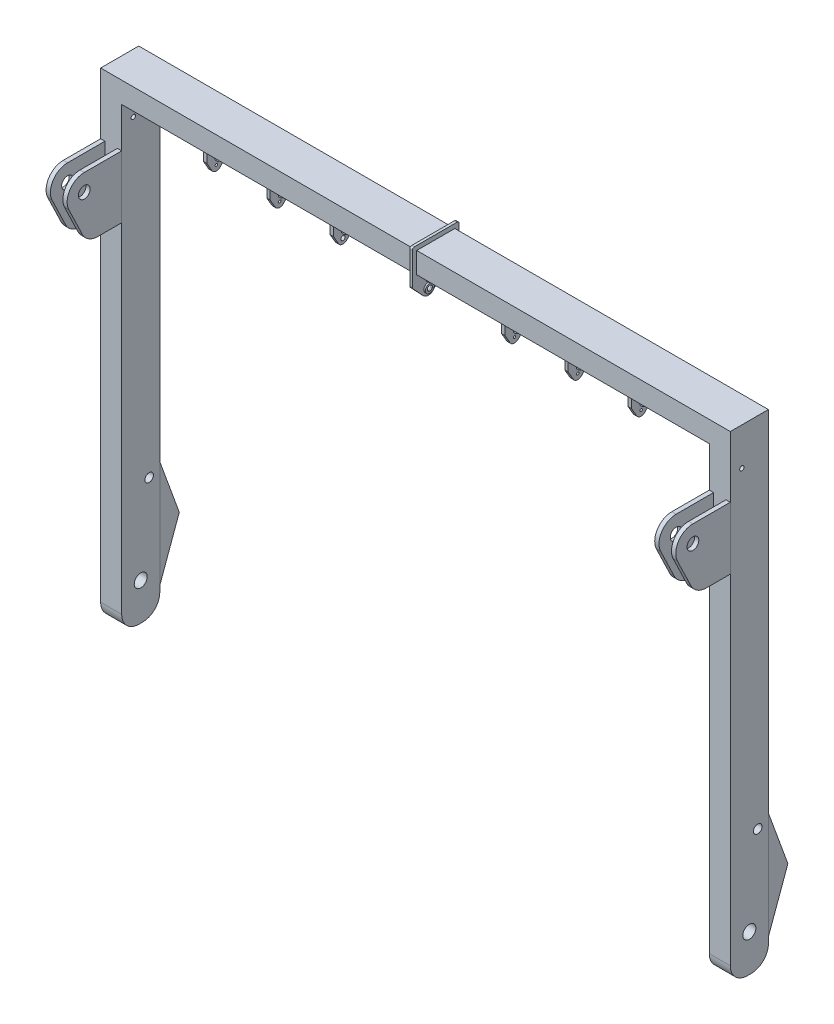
from build123d import *

# Parameters (mm, degrees)
BOSS_EXTRUDE1_DEPTH  = 225.65
BOSS_EXTRUDE11_START = 1016
SKETCH13_R           = 14.5
BOSS_EXTRUDE11_DEPTH = 20
SKETCH7_R            = 26
BOSS_EXTRUDE6_DEPTH  = 15
SKETCH2_R            = 76.982489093
SKETCH2_R_2          = 26
CUT_EXTRUDE1_DEPTH   = 9415.629699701
FILLET1_R            = 203.2
SKETCH3_R            = 69.780574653
BOSS_EXTRUDE2_DEPTH  = 50.8
SKETCH4_R            = 69.780574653
BOSS_EXTRUDE3_DEPTH  = 50.8
SKETCH5_R            = 69.780574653
BOSS_EXTRUDE4_DEPTH  = 50.8
SKETCH6_R            = 69.780574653
BOSS_EXTRUDE5_DEPTH  = 50.8
BOSS_EXTRUDE7_DEPTH  = 249.3
BOSS_EXTRUDE8_DEPTH  = 249.3
SKETCH10_R           = 50.8
CUT_EXTRUDE2_DEPTH   = 9451.827347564
SKETCH11_R           = 52.5
SKETCH11_R_2         = 26
BOSS_EXTRUDE9_DEPTH  = 18
SKETCH12_R           = 52.5
SKETCH12_R_2         = 26
BOSS_EXTRUDE10_DEPTH = 18
LPATTERN1_COUNT      = 3
LPATTERN1_PITCH      = 750
BOSS_EXTRUDE12_START = -1016
SKETCH15_R           = 14.5
BOSS_EXTRUDE12_DEPTH = 20
LPATTERN2_COUNT      = 3
LPATTERN2_PITCH      = 750
BOSS_EXTRUDE14_START = -125
BOSS_EXTRUDE14_DEPTH = 12.5
BOSS_EXTRUDE15_START = -135
BOSS_EXTRUDE15_DEPTH = 12.5
LPATTERN3_COUNT      = 3
LPATTERN3_PITCH      = 750
BOSS_EXTRUDE16_START = -135
BOSS_EXTRUDE16_DEPTH = 12.5
LPATTERN6_COUNT      = 3
LPATTERN6_PITCH      = 750
FILLET2_R            = 25
SKETCH20_R           = 29.964
CUT_EXTRUDE3_DEPTH   = 38.1
CHAMFER1_SIZE        = 1.27
CHAMFER1_SIZE2       = 0.340295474
CHAMFER2_SIZE        = 1.27
CHAMFER2_SIZE2       = 0.340295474
FILLET3_R            = 0.127
FILLET4_R            = 0.127


with BuildPart() as part:
    # Sketch1 → Boss-Extrude1 (new, symmetric)
    with BuildSketch(Plane.XY):
        Polygon((-3730, 0), (-3730, 5684.8), (3730, 5684.8), (3730, 0), (3480.7, 0), (3480.7, 5435.5), (-3480.7, 5435.5), (-3480.7, 0), align=None)
    extrude(amount=BOSS_EXTRUDE1_DEPTH, both=True)

    # Sketch13 → Boss-Extrude11 (add, symmetric)
    with BuildSketch(Plane.ZY.offset(0.01).offset(BOSS_EXTRUDE11_START)):
        with BuildLine():
            Line((-200.35, 5435.5), (-200.35, 5387.4))
            Line((-200.35, 5387.4), (-57.650824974, 5305.012592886))
            Line((-57.650824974, 5305.012592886), (42.165047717, 5196.572300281))
            ThreePointArc((42.165047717, 5196.572300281), (96.83095698, 5177.005808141), (144.004943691, 5210.855833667))
            Line((144.004943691, 5210.855833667), (201.65, 5310.7))
            Line((201.65, 5310.7), (201.65, 5435.5))
            Line((201.65, 5435.5), (-200.35, 5435.5))
        make_face()
        with Locations((88.15, 5238.9)):
            Circle(SKETCH13_R, mode=Mode.SUBTRACT)
    boss_extrude11 = extrude(amount=BOSS_EXTRUDE11_DEPTH, both=True)

    # Sketch7 → Boss-Extrude6 (add, symmetric)
    with BuildSketch(Plane.ZY.offset(0.01)):
        with BuildLine():
            Line((278.15, 5321.682022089), (148.486680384, 5182.635135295))
            ThreePointArc((148.486680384, 5182.635135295), (82.395090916, 5156.600965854), (20.569956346, 5191.579944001))
            Line((20.569956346, 5191.579944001), (-51.53588504, 5294.557757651))
            Line((-51.53588504, 5294.557757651), (-277.25, 5399.809978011))
            Line((-277.25, 5399.809978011), (-277.25, 5736.4))
            Line((-277.25, 5736.4), (278.15, 5736.4))
            Line((278.15, 5736.4), (278.15, 5321.682022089))
        make_face()
        with Locations((88.15, 5238.9)):
            Circle(SKETCH7_R, mode=Mode.SUBTRACT)
    extrude(amount=BOSS_EXTRUDE6_DEPTH, both=True)

    # Sketch2 → Cut-Extrude1 (cut, through all)
    with BuildSketch(Plane(origin=(3730, 0, 0), x_dir=(0, 0, -1), z_dir=(1, 0, 0))):
        with Locations(Location((0, 439.109386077, 0), (0, 0, 90))):
            Circle(SKETCH2_R)
        with Locations(Location((-88.15, 5238.9, 0), (0, 0, 180))):
            Circle(SKETCH2_R_2)
    extrude(amount=-CUT_EXTRUDE1_DEPTH, mode=Mode.SUBTRACT)

    # Fillet1
    fillet1_edges = [part.edges().sort_by_distance(p)[0] for p in [
        (-3605.35, 0, -225.65),
        (3605.35, 0, 225.65),
        (-3605.35, 0, 225.65),
        (3605.35, 0, -225.65),
    ]]
    fillet(fillet1_edges, radius=FILLET1_R)

    # Sketch10 → Cut-Extrude2 (cut, through all)
    with BuildSketch(Plane.ZY.offset(3730)):
        with Locations((-100, 1444.109386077)):
            Circle(SKETCH10_R)
    extrude(amount=-CUT_EXTRUDE2_DEPTH, mode=Mode.SUBTRACT)

    # LPattern1: Boss-Extrude11 ×3
    with Locations(*[(-i * LPATTERN1_PITCH, 0, 0) for i in range(1, LPATTERN1_COUNT)]):
        add(boss_extrude11)

    # Sketch15 → Boss-Extrude12 (add, symmetric)
    with BuildSketch(Plane.ZY.offset(0.01).offset(BOSS_EXTRUDE12_START)):
        with BuildLine():
            Line((-200.35, 5435.5), (-200.35, 5387.4))
            Line((-200.35, 5387.4), (-57.650824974, 5305.012592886))
            Line((-57.650824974, 5305.012592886), (42.165047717, 5196.572300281))
            ThreePointArc((42.165047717, 5196.572300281), (96.83095698, 5177.005808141), (144.004943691, 5210.855833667))
            Line((144.004943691, 5210.855833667), (201.65, 5310.7))
            Line((201.65, 5310.7), (201.65, 5435.5))
            Line((201.65, 5435.5), (-200.35, 5435.5))
        make_face()
        with Locations((88.15, 5238.9)):
            Circle(SKETCH15_R, mode=Mode.SUBTRACT)
    boss_extrude12 = extrude(amount=BOSS_EXTRUDE12_DEPTH, both=True)

    # LPattern2: Boss-Extrude12 ×3
    with Locations(*[(i * LPATTERN2_PITCH, 0, 0) for i in range(1, LPATTERN2_COUNT)]):
        add(boss_extrude12)

    # Sketch16 → Boss-Extrude14 (add, symmetric)
    with BuildSketch(Plane.XY.offset(225.65).offset(BOSS_EXTRUDE14_START)):
        with BuildLine():
            Line((14.99, 5395.5), (14.99, 5315.5))
            Line((14.99, 5315.5), (54.99, 5315.5))
            Line((54.99, 5315.5), (214.99, 5395.5))
            Line((214.99, 5395.5), (214.99, 5435.5))
            Line((214.99, 5435.5), (54.99, 5435.5))
            ThreePointArc((54.99, 5435.5), (43.274271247, 5407.215728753), (14.99, 5395.5))
        make_face()
        with BuildLine():
            Line((-215.01, 5435.5), (-55.01, 5435.5))
            ThreePointArc((-55.01, 5435.5), (-43.294271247, 5407.215728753), (-15.01, 5395.5))
            Line((-15.01, 5395.5), (-15.01, 5315.5))
            Line((-15.01, 5315.5), (-55.01, 5315.5))
            Line((-55.01, 5315.5), (-215.01, 5395.5))
            Line((-215.01, 5395.5), (-215.01, 5435.5))
        make_face()
    extrude(amount=BOSS_EXTRUDE14_DEPTH, both=True)

    # Sketch17 → Boss-Extrude15 (add, symmetric)
    with BuildSketch(Plane.XY.offset(225.65).offset(BOSS_EXTRUDE15_START)):
        Polygon((995.99, 5295.5), (970.59, 5295.5), (767.39, 5410.1), (767.39, 5435.5), (995.99, 5435.5), align=None)
        Polygon((1035.99, 5435.5), (1035.99, 5295.5), (1061.39, 5295.5), (1264.59, 5410.1), (1264.59, 5435.5), align=None)
    boss_extrude15 = extrude(amount=BOSS_EXTRUDE15_DEPTH, both=True)

    # LPattern3: Boss-Extrude15 ×3
    with Locations(*[(i * LPATTERN3_PITCH, 0, 0) for i in range(1, LPATTERN3_COUNT)]):
        add(boss_extrude15)

    # Sketch18 → Boss-Extrude16 (add, symmetric)
    with BuildSketch(Plane.XY.offset(225.65).offset(BOSS_EXTRUDE16_START)):
        Polygon((-996.01, 5435.5), (-996.01, 5295.5), (-970.61, 5295.5), (-767.41, 5410.1), (-767.41, 5435.5), align=None)
        Polygon((-1264.61, 5435.5), (-1036.01, 5435.5), (-1036.01, 5295.5), (-1061.41, 5295.5), (-1264.61, 5410.1), align=None)
    boss_extrude16 = extrude(amount=BOSS_EXTRUDE16_DEPTH, both=True)

    # LPattern6: Boss-Extrude16 ×3
    with Locations(*[(-i * LPATTERN6_PITCH, 0, 0) for i in range(1, LPATTERN6_COUNT)]):
        add(boss_extrude16)

    # Fillet2
    fillet2_edges = [part.edges().sort_by_distance(p)[0] for p in [
        (-0.01, 5736.4, 278.15),
        (-0.01, 5736.4, -277.25),
        (-0.01, 5399.809978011, -277.25),
        (-0.01, 5321.682022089, 278.15),
    ]]
    fillet(fillet2_edges, radius=FILLET2_R)


with BuildPart() as body_2:
    # Sketch3 → Boss-Extrude2 (new body)
    with BuildSketch(Plane.ZY.offset(3730)):
        with BuildLine():
            Line((225.65, 4959.127348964), (668.724648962, 4959.127348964))
            ThreePointArc((668.724648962, 4959.127348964), (840.721407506, 4864.127880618), (851.895325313, 4667.957221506))
            Line((851.895325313, 4667.957221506), (692.844983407, 4336.783906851))
            ThreePointArc((692.844983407, 4336.783906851), (617.87483871, 4252.757275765), (509.674307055, 4221.554034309))
            Line((509.674307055, 4221.554034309), (225.65, 4221.554034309))
            Line((225.65, 4221.554034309), (225.65, 4959.127348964))
        make_face()
        with Locations((668.724648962, 4755.927348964)):
            Circle(SKETCH3_R, mode=Mode.SUBTRACT)
    extrude(amount=-BOSS_EXTRUDE2_DEPTH)


with BuildPart() as body_3:
    # Sketch4 → Boss-Extrude3 (new body)
    with BuildSketch(Plane(origin=(-3480.7, 0, 0), x_dir=(0, 0, -1), z_dir=(1, 0, 0))):
        with BuildLine():
            Line((-225.65, 4221.554034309), (-225.65, 4959.127348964))
            Line((-225.65, 4959.127348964), (-668.724648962, 4959.127348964))
            ThreePointArc((-668.724648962, 4959.127348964), (-840.721407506, 4864.127880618), (-851.895325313, 4667.957221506))
            Line((-851.895325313, 4667.957221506), (-692.844983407, 4336.783906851))
            ThreePointArc((-692.844983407, 4336.783906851), (-617.87483871, 4252.757275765), (-509.674307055, 4221.554034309))
            Line((-509.674307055, 4221.554034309), (-225.65, 4221.554034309))
        make_face()
        with Locations((-668.724648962, 4755.927348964)):
            Circle(SKETCH4_R, mode=Mode.SUBTRACT)
    extrude(amount=-BOSS_EXTRUDE3_DEPTH)


with BuildPart() as body_4:
    # Sketch5 → Boss-Extrude4 (new body)
    with BuildSketch(Plane(origin=(3730, 0, 0), x_dir=(0, 0, -1), z_dir=(1, 0, 0))):
        with BuildLine():
            Line((-509.674307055, 4221.554034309), (-225.65, 4221.554034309))
            Line((-225.65, 4221.554034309), (-225.65, 4959.127348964))
            Line((-225.65, 4959.127348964), (-668.724648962, 4959.127348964))
            ThreePointArc((-668.724648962, 4959.127348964), (-840.721407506, 4864.127880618), (-851.895325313, 4667.957221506))
            Line((-851.895325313, 4667.957221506), (-692.844983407, 4336.783906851))
            ThreePointArc((-692.844983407, 4336.783906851), (-617.87483871, 4252.757275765), (-509.674307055, 4221.554034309))
        make_face()
        with Locations(Location((-668.724648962, 4755.927348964, 0), (0, 0, 90))):
            Circle(SKETCH5_R, mode=Mode.SUBTRACT)
    extrude(amount=-BOSS_EXTRUDE4_DEPTH)


with BuildPart() as body_5:
    # Sketch6 → Boss-Extrude5 (new body)
    with BuildSketch(Plane.ZY.offset(-3480.7)):
        with BuildLine():
            Line((692.844983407, 4336.783906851), (851.895325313, 4667.957221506))
            ThreePointArc((851.895325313, 4667.957221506), (840.721407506, 4864.127880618), (668.724648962, 4959.127348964))
            Line((668.724648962, 4959.127348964), (225.65, 4959.127348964))
            Line((225.65, 4959.127348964), (225.65, 4221.554034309))
            Line((225.65, 4221.554034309), (509.674307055, 4221.554034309))
            ThreePointArc((509.674307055, 4221.554034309), (617.87483871, 4252.757275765), (692.844983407, 4336.783906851))
        make_face()
        with Locations((668.724648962, 4755.927348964)):
            Circle(SKETCH6_R, mode=Mode.SUBTRACT)
    extrude(amount=-BOSS_EXTRUDE5_DEPTH)


with BuildPart() as body_6:
    # Sketch8 → Boss-Extrude7 (new body)
    with BuildSketch(Plane.ZY.offset(3730)):
        Polygon((-225.65, 1544.477384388), (-456.771098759, 909.477384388), (-225.65, 274.477384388), align=None)
    extrude(amount=-BOSS_EXTRUDE7_DEPTH)


with BuildPart() as body_7:
    # Sketch9 → Boss-Extrude8 (new body)
    with BuildSketch(Plane(origin=(3730, 0, 0), x_dir=(0, 0, -1), z_dir=(1, 0, 0))):
        Polygon((225.65, 1544.477384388), (225.65, 274.477384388), (456.771098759, 909.477384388), align=None)
    extrude(amount=-BOSS_EXTRUDE8_DEPTH)


with BuildPart() as body_8:
    # Sketch11 → Boss-Extrude9 (new body)
    with BuildSketch(Plane.ZY.offset(15.01)):
        with Locations((88.15, 5238.9)):
            Circle(SKETCH11_R)
        with Locations((88.15, 5238.9)):
            Circle(SKETCH11_R_2, mode=Mode.SUBTRACT)
    extrude(amount=BOSS_EXTRUDE9_DEPTH)


with BuildPart() as body_9:
    # Sketch12 → Boss-Extrude10 (new body)
    with BuildSketch(Plane(origin=(14.99, 0, 0), x_dir=(0, 0, -1), z_dir=(1, 0, 0))):
        with Locations((-88.15, 5238.9)):
            Circle(SKETCH12_R)
        with Locations((-88.15, 5238.9)):
            Circle(SKETCH12_R_2, mode=Mode.SUBTRACT)
    extrude(amount=BOSS_EXTRUDE10_DEPTH)


with BuildPart() as cut_extrude3_tool:
    # Sketch20 → Cut-Extrude3 (new, symmetric)
    with BuildSketch(Plane.ZY.offset(0.01)):
        with Locations((88.15, 5238.9)):
            Circle(SKETCH20_R)
    extrude(amount=CUT_EXTRUDE3_DEPTH, both=True)


with BuildPart() as part_1:
    add(part.part)

    # Cut-Extrude3: cut by cut_extrude3_tool
    add(cut_extrude3_tool.part, mode=Mode.SUBTRACT)


with BuildPart() as body_8_1:
    add(body_8.part)

    # Cut-Extrude3: cut by cut_extrude3_tool
    add(cut_extrude3_tool.part, mode=Mode.SUBTRACT)

    # Chamfer1
    chamfer1_edges = [body_8_1.edges().sort_by_distance(p)[0] for p in [
        (-33.01, 5238.9, 58.186),
    ]]
    chamfer1_side = [body_8_1.faces().sort_by_distance(p)[0] for p in [
        (-24.01, 5238.9, 58.186),
    ]]
    chamfer(chamfer1_edges, length=CHAMFER1_SIZE, length2=CHAMFER1_SIZE2, reference=chamfer1_side[0])

    # Fillet4
    fillet4_edges = [body_8_1.edges().sort_by_distance(p)[0] for p in [
        (-31.74, 5238.9, 58.186),
        (-33.01, 5238.9, 57.845704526),
    ]]
    fillet(fillet4_edges, radius=FILLET4_R)


with BuildPart() as body_9_1:
    add(body_9.part)

    # Cut-Extrude3: cut by cut_extrude3_tool
    add(cut_extrude3_tool.part, mode=Mode.SUBTRACT)

    # Chamfer2
    chamfer2_edges = [body_9_1.edges().sort_by_distance(p)[0] for p in [
        (32.99, 5238.9, 58.186),
    ]]
    chamfer2_side = [body_9_1.faces().sort_by_distance(p)[0] for p in [
        (23.99, 5238.9, 58.186),
    ]]
    chamfer(chamfer2_edges, length=CHAMFER2_SIZE, length2=CHAMFER2_SIZE2, reference=chamfer2_side[0])

    # Fillet3
    fillet3_edges = [body_9_1.edges().sort_by_distance(p)[0] for p in [
        (31.72, 5238.9, 58.186),
        (32.99, 5238.9, 57.845704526),
    ]]
    fillet(fillet3_edges, radius=FILLET3_R)


solid = Compound([body_2.part, body_3.part, body_4.part, body_5.part, body_6.part, body_7.part, part_1.part, body_8_1.part, body_9_1.part])
